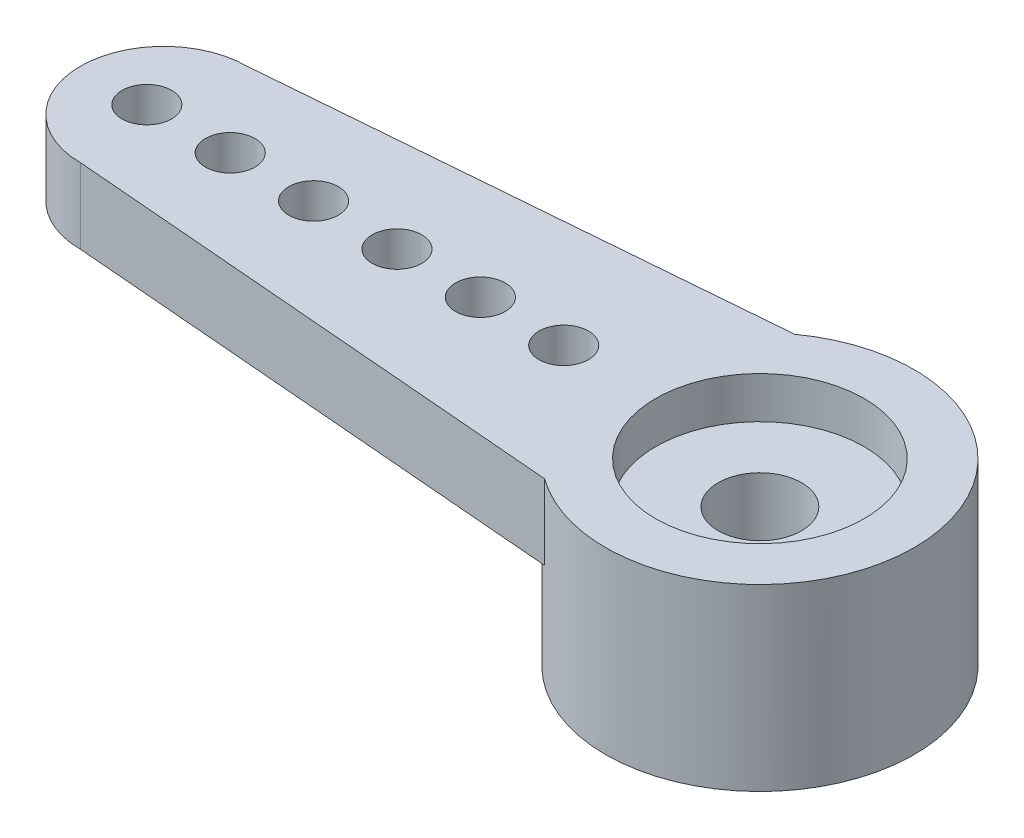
from build123d import *

# Parameters (mm, degrees)
CROQUIS1_R              = 3.7
SALIENTE_EXTRUIR2_DEPTH = 4.3
CROQUIS2_R              = 2.5
CORTAR_EXTRUIR1_DEPTH   = 1.5
CORTAR_EXTRUIR2_START   = -1
CROQUIS3_R              = 2.5
CORTAR_EXTRUIR2_DEPTH   = 1
CROQUIS4_R              = 1
CORTAR_EXTRUIR3_DEPTH   = 1.8
SALIENTE_EXTRUIR3_DEPTH = 1.8
CROQUIS6_R              = 0.595
CORTAR_EXTRUIR4_DEPTH   = 1.8


with BuildPart() as part:
    # Croquis1 → Saliente-Extruir2 (new body)
    with BuildSketch(Plane(origin=(0, 0, 0), x_dir=(1, 0, 0), z_dir=(0, 1, 0))):
        with Locations(Location((0, 0, 0), (0, 0, 90))):
            Circle(CROQUIS1_R)
    extrude(amount=SALIENTE_EXTRUIR2_DEPTH)

    # Croquis2 → Cortar-Extruir1 (cut)
    with BuildSketch(Plane.XZ):
        with Locations(Location((0, 0, 0), (0, 0, 270))):
            Circle(CROQUIS2_R)
    extrude(amount=-CORTAR_EXTRUIR1_DEPTH, mode=Mode.SUBTRACT)

    # Croquis3 → Cortar-Extruir2 (cut)
    with BuildSketch(Plane(origin=(0, 4.3, 0), x_dir=(1, 0, 0), z_dir=(0, 1, 0)).offset(CORTAR_EXTRUIR2_START)):
        with Locations(Location((0, 0, 0), (0, 0, 90))):
            Circle(CROQUIS3_R)
    extrude(amount=CORTAR_EXTRUIR2_DEPTH, mode=Mode.SUBTRACT)

    # Croquis4 → Cortar-Extruir3 (cut)
    with BuildSketch(Plane(origin=(0, 3.3, 0), x_dir=(1, 0, 0), z_dir=(0, 1, 0))):
        with Locations(Location((0, 0, 0), (0, 0, 270))):
            Circle(CROQUIS4_R)
    extrude(amount=-CORTAR_EXTRUIR3_DEPTH, mode=Mode.SUBTRACT)

    # Croquis5 → Saliente-Extruir3 (add)
    with BuildSketch(Plane(origin=(0, 4.3, 0), x_dir=(1, 0, 0), z_dir=(0, 1, 0))):
        with BuildLine():
            Line((-2.16564, 3.000000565), (-3.120237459, 0))
            Line((-3.120237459, 0), (-2.16564, -3.000000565))
            Line((-2.16564, -3.000000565), (-14.3, -2))
            ThreePointArc((-14.3, -2), (-16.3, 0), (-14.3, 2))
            Line((-14.3, 2), (-2.16564, 3.000000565))
        make_face()
    extrude(amount=-SALIENTE_EXTRUIR3_DEPTH)

    # Croquis6 → Cortar-Extruir4 (cut)
    with BuildSketch(Plane(origin=(0, 4.3, 0), x_dir=(1, 0, 0), z_dir=(0, 1, 0))):
        with Locations(Location((-14.705, 0, 0), (0, 0, 270))):
            Circle(CROQUIS6_R)
        with Locations(Location((-12.705, 0, 0), (0, 0, 270))):
            Circle(CROQUIS6_R)
        with Locations(Location((-10.705, 0, 0), (0, 0, 270))):
            Circle(CROQUIS6_R)
        with Locations(Location((-8.705, 0, 0), (0, 0, 270))):
            Circle(CROQUIS6_R)
        with Locations(Location((-6.705, 0, 0), (0, 0, 270))):
            Circle(CROQUIS6_R)
        with Locations(Location((-4.705, 0, 0), (0, 0, 270))):
            Circle(CROQUIS6_R)
    extrude(amount=-CORTAR_EXTRUIR4_DEPTH, mode=Mode.SUBTRACT)


solid = part.part
